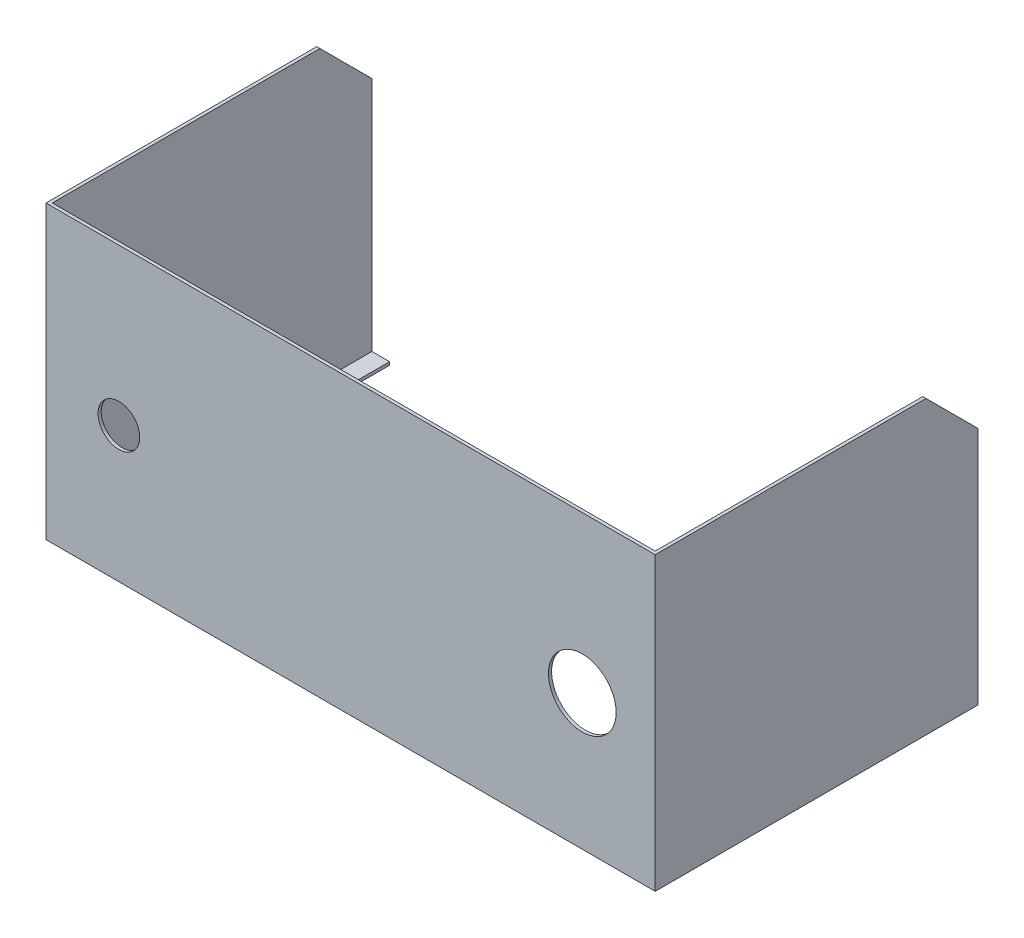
ISO-10303-21;
HEADER;
FILE_DESCRIPTION(('STEP AP214'),'2;1');
FILE_NAME('part.step','',(''),(''),'','','');
FILE_SCHEMA(('AUTOMOTIVE_DESIGN { 1 0 10303 214 1 1 1 1 }'));
ENDSEC;
DATA;
#1=APPLICATION_CONTEXT('core data for automotive mechanical design processes');
#2=APPLICATION_PROTOCOL_DEFINITION('international standard','automotive_design',2000,#1);
#3=PRODUCT_CONTEXT('',#1,'mechanical');
#4=PRODUCT('Part','Part','',(#3));
#5=PRODUCT_RELATED_PRODUCT_CATEGORY('part','',(#4));
#6=PRODUCT_DEFINITION_FORMATION('','',#4);
#7=PRODUCT_DEFINITION_CONTEXT('part definition',#1,'design');
#8=PRODUCT_DEFINITION('design','',#6,#7);
#9=PRODUCT_DEFINITION_SHAPE('','',#8);
#10=(LENGTH_UNIT() NAMED_UNIT(*) SI_UNIT(.MILLI.,.METRE.));
#11=(NAMED_UNIT(*) PLANE_ANGLE_UNIT() SI_UNIT($,.RADIAN.));
#12=(NAMED_UNIT(*) SI_UNIT($,.STERADIAN.) SOLID_ANGLE_UNIT());
#13=UNCERTAINTY_MEASURE_WITH_UNIT(LENGTH_MEASURE(1.E-05),#10,'distance_accuracy_value','');
#14=(GEOMETRIC_REPRESENTATION_CONTEXT(3) GLOBAL_UNCERTAINTY_ASSIGNED_CONTEXT((#13)) GLOBAL_UNIT_ASSIGNED_CONTEXT((#10,
#11,#12)) REPRESENTATION_CONTEXT('',''));
#15=CARTESIAN_POINT('',(0.,0.,0.));
#16=DIRECTION('',(0.,0.,1.));
#17=DIRECTION('',(1.,0.,0.));
#18=AXIS2_PLACEMENT_3D('',#15,#16,#17);
#19=CARTESIAN_POINT('',(0.,0.,0.));
#20=DIRECTION('',(0.,0.,-1.));
#21=DIRECTION('',(-1.,0.,0.));
#22=AXIS2_PLACEMENT_3D('',#19,#20,#21);
#23=PLANE('',#22);
#24=CARTESIAN_POINT('',(-222.5,-10.,0.));
#25=DIRECTION('',(0.,0.,1.));
#26=DIRECTION('',(1.,0.,0.));
#27=AXIS2_PLACEMENT_3D('',#24,#25,#26);
#28=CIRCLE('',#27,20.);
#29=CARTESIAN_POINT('',(-202.5,-10.,0.));
#30=VERTEX_POINT('',#29);
#31=EDGE_CURVE('E243',#30,#30,#28,.T.);
#32=ORIENTED_EDGE('',*,*,#31,.T.);
#33=EDGE_LOOP('',(#32));
#34=FACE_BOUND('',#33,.T.);
#35=CARTESIAN_POINT('',(222.5,-9.99999999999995,0.));
#36=DIRECTION('',(0.,0.,1.));
#37=DIRECTION('',(1.,0.,0.));
#38=AXIS2_PLACEMENT_3D('',#35,#36,#37);
#39=CIRCLE('',#38,32.5);
#40=CARTESIAN_POINT('',(255.,-9.99999999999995,0.));
#41=VERTEX_POINT('',#40);
#42=EDGE_CURVE('E235',#41,#41,#39,.T.);
#43=ORIENTED_EDGE('',*,*,#42,.T.);
#44=EDGE_LOOP('',(#43));
#45=FACE_BOUND('',#44,.T.);
#46=DIRECTION('',(0.,-1.,0.));
#47=VECTOR('',#46,1.);
#48=CARTESIAN_POINT('',(289.5,-140.,0.));
#49=LINE('',#48,#47);
#50=CARTESIAN_POINT('',(289.5,140.,0.));
#51=VERTEX_POINT('',#50);
#52=CARTESIAN_POINT('',(289.5,-137.,0.));
#53=VERTEX_POINT('',#52);
#54=EDGE_CURVE('E224',#51,#53,#49,.T.);
#55=ORIENTED_EDGE('',*,*,#54,.T.);
#56=DIRECTION('',(1.,0.,0.));
#57=VECTOR('',#56,1.);
#58=CARTESIAN_POINT('',(0.,-137.,0.));
#59=LINE('',#58,#57);
#60=CARTESIAN_POINT('',(-289.5,-137.,0.));
#61=VERTEX_POINT('',#60);
#62=EDGE_CURVE('E173',#61,#53,#59,.T.);
#63=ORIENTED_EDGE('',*,*,#62,.F.);
#64=DIRECTION('',(0.,1.,0.));
#65=VECTOR('',#64,1.);
#66=CARTESIAN_POINT('',(-289.5,-140.,0.));
#67=LINE('',#66,#65);
#68=CARTESIAN_POINT('',(-289.5,140.,0.));
#69=VERTEX_POINT('',#68);
#70=EDGE_CURVE('E194',#61,#69,#67,.T.);
#71=ORIENTED_EDGE('',*,*,#70,.T.);
#72=DIRECTION('',(-1.,0.,0.));
#73=VECTOR('',#72,1.);
#74=CARTESIAN_POINT('',(292.5,140.,0.));
#75=LINE('',#74,#73);
#76=EDGE_CURVE('E249',#51,#69,#75,.T.);
#77=ORIENTED_EDGE('',*,*,#76,.F.);
#78=EDGE_LOOP('',(#55,#63,#71,#77));
#79=FACE_BOUND('',#78,.T.);
#80=ADVANCED_FACE('F36',(#34,#45,#79),#23,.T.);
#81=CARTESIAN_POINT('',(289.5,0.,0.));
#82=DIRECTION('',(1.,0.,0.));
#83=DIRECTION('',(0.,0.,-1.));
#84=AXIS2_PLACEMENT_3D('',#81,#82,#83);
#85=PLANE('',#84);
#86=DIRECTION('',(0.,0.,-1.));
#87=VECTOR('',#86,1.);
#88=CARTESIAN_POINT('',(289.5,-137.,0.));
#89=LINE('',#88,#87);
#90=CARTESIAN_POINT('',(289.5,-137.,-307.));
#91=VERTEX_POINT('',#90);
#92=EDGE_CURVE('E171',#53,#91,#89,.T.);
#93=ORIENTED_EDGE('',*,*,#92,.F.);
#94=ORIENTED_EDGE('',*,*,#54,.F.);
#95=DIRECTION('',(0.,0.,1.));
#96=VECTOR('',#95,1.);
#97=CARTESIAN_POINT('',(289.5,140.,0.));
#98=LINE('',#97,#96);
#99=CARTESIAN_POINT('',(289.5,140.,-257.));
#100=VERTEX_POINT('',#99);
#101=EDGE_CURVE('E222',#100,#51,#98,.T.);
#102=ORIENTED_EDGE('',*,*,#101,.F.);
#103=DIRECTION('',(0.,0.707106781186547,0.707106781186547));
#104=VECTOR('',#103,1.);
#105=CARTESIAN_POINT('',(289.5,140.,-257.));
#106=LINE('',#105,#104);
#107=CARTESIAN_POINT('',(289.5,90.0000000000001,-307.));
#108=VERTEX_POINT('',#107);
#109=EDGE_CURVE('E218',#108,#100,#106,.T.);
#110=ORIENTED_EDGE('',*,*,#109,.F.);
#111=DIRECTION('',(0.,1.,0.));
#112=VECTOR('',#111,1.);
#113=CARTESIAN_POINT('',(289.5,-140.,-307.));
#114=LINE('',#113,#112);
#115=EDGE_CURVE('E216',#91,#108,#114,.T.);
#116=ORIENTED_EDGE('',*,*,#115,.F.);
#117=EDGE_LOOP('',(#93,#94,#102,#110,#116));
#118=FACE_BOUND('',#117,.T.);
#119=ADVANCED_FACE('F305',(#118),#85,.F.);
#120=CARTESIAN_POINT('',(-289.5,0.,0.));
#121=DIRECTION('',(-1.,0.,0.));
#122=DIRECTION('',(0.,0.,1.));
#123=AXIS2_PLACEMENT_3D('',#120,#121,#122);
#124=PLANE('',#123);
#125=DIRECTION('',(0.,0.,1.));
#126=VECTOR('',#125,1.);
#127=CARTESIAN_POINT('',(-289.5,-137.,0.));
#128=LINE('',#127,#126);
#129=CARTESIAN_POINT('',(-289.5,-137.,-307.));
#130=VERTEX_POINT('',#129);
#131=EDGE_CURVE('E175',#130,#61,#128,.T.);
#132=ORIENTED_EDGE('',*,*,#131,.F.);
#133=DIRECTION('',(0.,-1.,0.));
#134=VECTOR('',#133,1.);
#135=CARTESIAN_POINT('',(-289.5,90.,-307.));
#136=LINE('',#135,#134);
#137=CARTESIAN_POINT('',(-289.5,90.,-307.));
#138=VERTEX_POINT('',#137);
#139=EDGE_CURVE('E191',#138,#130,#136,.T.);
#140=ORIENTED_EDGE('',*,*,#139,.F.);
#141=DIRECTION('',(0.,-0.707106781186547,-0.707106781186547));
#142=VECTOR('',#141,1.);
#143=CARTESIAN_POINT('',(-289.5,140.,-257.));
#144=LINE('',#143,#142);
#145=CARTESIAN_POINT('',(-289.5,140.,-257.));
#146=VERTEX_POINT('',#145);
#147=EDGE_CURVE('E200',#146,#138,#144,.T.);
#148=ORIENTED_EDGE('',*,*,#147,.F.);
#149=DIRECTION('',(0.,0.,-1.));
#150=VECTOR('',#149,1.);
#151=CARTESIAN_POINT('',(-289.5,140.,0.));
#152=LINE('',#151,#150);
#153=EDGE_CURVE('E197',#69,#146,#152,.T.);
#154=ORIENTED_EDGE('',*,*,#153,.F.);
#155=ORIENTED_EDGE('',*,*,#70,.F.);
#156=EDGE_LOOP('',(#132,#140,#148,#154,#155));
#157=FACE_BOUND('',#156,.T.);
#158=ADVANCED_FACE('F295',(#157),#124,.F.);
#159=CARTESIAN_POINT('',(0.,0.,3.));
#160=DIRECTION('',(0.,0.,-1.));
#161=DIRECTION('',(-1.,0.,0.));
#162=AXIS2_PLACEMENT_3D('',#159,#160,#161);
#163=PLANE('',#162);
#164=DIRECTION('',(0.,-1.,0.));
#165=VECTOR('',#164,1.);
#166=CARTESIAN_POINT('',(-292.5,140.,3.));
#167=LINE('',#166,#165);
#168=CARTESIAN_POINT('',(-292.5,140.,3.));
#169=VERTEX_POINT('',#168);
#170=CARTESIAN_POINT('',(-292.5,-140.,3.));
#171=VERTEX_POINT('',#170);
#172=EDGE_CURVE('E252',#169,#171,#167,.T.);
#173=ORIENTED_EDGE('',*,*,#172,.T.);
#174=DIRECTION('',(1.,0.,0.));
#175=VECTOR('',#174,1.);
#176=CARTESIAN_POINT('',(292.5,-140.,3.));
#177=LINE('',#176,#175);
#178=CARTESIAN_POINT('',(292.5,-140.,3.));
#179=VERTEX_POINT('',#178);
#180=EDGE_CURVE('E254',#171,#179,#177,.T.);
#181=ORIENTED_EDGE('',*,*,#180,.T.);
#182=DIRECTION('',(0.,1.,0.));
#183=VECTOR('',#182,1.);
#184=CARTESIAN_POINT('',(292.5,140.,3.));
#185=LINE('',#184,#183);
#186=CARTESIAN_POINT('',(292.5,140.,3.));
#187=VERTEX_POINT('',#186);
#188=EDGE_CURVE('E56',#179,#187,#185,.T.);
#189=ORIENTED_EDGE('',*,*,#188,.T.);
#190=DIRECTION('',(-1.,0.,0.));
#191=VECTOR('',#190,1.);
#192=CARTESIAN_POINT('',(292.5,140.,3.));
#193=LINE('',#192,#191);
#194=EDGE_CURVE('E51',#187,#169,#193,.T.);
#195=ORIENTED_EDGE('',*,*,#194,.T.);
#196=EDGE_LOOP('',(#173,#181,#189,#195));
#197=FACE_BOUND('',#196,.T.);
#198=CARTESIAN_POINT('',(-222.5,-10.,3.));
#199=DIRECTION('',(0.,0.,1.));
#200=DIRECTION('',(1.,0.,0.));
#201=AXIS2_PLACEMENT_3D('',#198,#199,#200);
#202=CIRCLE('',#201,20.);
#203=CARTESIAN_POINT('',(-202.5,-10.,3.));
#204=VERTEX_POINT('',#203);
#205=EDGE_CURVE('E246',#204,#204,#202,.T.);
#206=ORIENTED_EDGE('',*,*,#205,.F.);
#207=EDGE_LOOP('',(#206));
#208=FACE_BOUND('',#207,.T.);
#209=CARTESIAN_POINT('',(222.5,-9.99999999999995,3.));
#210=DIRECTION('',(0.,0.,1.));
#211=DIRECTION('',(1.,0.,0.));
#212=AXIS2_PLACEMENT_3D('',#209,#210,#211);
#213=CIRCLE('',#212,32.5);
#214=CARTESIAN_POINT('',(255.,-9.99999999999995,3.));
#215=VERTEX_POINT('',#214);
#216=EDGE_CURVE('E240',#215,#215,#213,.T.);
#217=ORIENTED_EDGE('',*,*,#216,.F.);
#218=EDGE_LOOP('',(#217));
#219=FACE_BOUND('',#218,.T.);
#220=ADVANCED_FACE('F283',(#197,#208,#219),#163,.F.);
#221=CARTESIAN_POINT('',(-292.5,140.,3.));
#222=DIRECTION('',(1.,0.,0.));
#223=DIRECTION('',(0.,1.,0.));
#224=AXIS2_PLACEMENT_3D('',#221,#222,#223);
#225=PLANE('',#224);
#226=DIRECTION('',(0.,0.,-1.));
#227=VECTOR('',#226,1.);
#228=CARTESIAN_POINT('',(-292.5,140.,3.));
#229=LINE('',#228,#227);
#230=CARTESIAN_POINT('',(-292.5,140.,-257.));
#231=VERTEX_POINT('',#230);
#232=EDGE_CURVE('E258',#169,#231,#229,.T.);
#233=ORIENTED_EDGE('',*,*,#232,.T.);
#234=DIRECTION('',(0.,-0.707106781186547,-0.707106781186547));
#235=VECTOR('',#234,1.);
#236=CARTESIAN_POINT('',(-292.5,140.,-257.));
#237=LINE('',#236,#235);
#238=CARTESIAN_POINT('',(-292.5,90.,-307.));
#239=VERTEX_POINT('',#238);
#240=EDGE_CURVE('E195',#231,#239,#237,.T.);
#241=ORIENTED_EDGE('',*,*,#240,.T.);
#242=DIRECTION('',(0.,-1.,0.));
#243=VECTOR('',#242,1.);
#244=CARTESIAN_POINT('',(-292.5,90.,-307.));
#245=LINE('',#244,#243);
#246=CARTESIAN_POINT('',(-292.5,-140.,-307.));
#247=VERTEX_POINT('',#246);
#248=EDGE_CURVE('E186',#239,#247,#245,.T.);
#249=ORIENTED_EDGE('',*,*,#248,.T.);
#250=DIRECTION('',(0.,0.,-1.));
#251=VECTOR('',#250,1.);
#252=CARTESIAN_POINT('',(-292.5,-140.,3.));
#253=LINE('',#252,#251);
#254=EDGE_CURVE('E11',#171,#247,#253,.T.);
#255=ORIENTED_EDGE('',*,*,#254,.F.);
#256=ORIENTED_EDGE('',*,*,#172,.F.);
#257=EDGE_LOOP('',(#233,#241,#249,#255,#256));
#258=FACE_BOUND('',#257,.T.);
#259=ADVANCED_FACE('F38',(#258),#225,.F.);
#260=CARTESIAN_POINT('',(292.5,-140.,3.));
#261=DIRECTION('',(0.,1.,0.));
#262=DIRECTION('',(-1.,0.,0.));
#263=AXIS2_PLACEMENT_3D('',#260,#261,#262);
#264=PLANE('',#263);
#265=CARTESIAN_POINT('',(280.5,-140.,-92.));
#266=DIRECTION('',(0.,-1.,0.));
#267=DIRECTION('',(1.,0.,0.));
#268=AXIS2_PLACEMENT_3D('',#265,#266,#267);
#269=CIRCLE('',#268,1.74999999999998);
#270=CARTESIAN_POINT('',(282.25,-140.,-92.));
#271=VERTEX_POINT('',#270);
#272=EDGE_CURVE('E343',#271,#271,#269,.T.);
#273=ORIENTED_EDGE('',*,*,#272,.F.);
#274=EDGE_LOOP('',(#273));
#275=FACE_BOUND('',#274,.T.);
#276=CARTESIAN_POINT('',(137.5,-140.,-9.00000000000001));
#277=DIRECTION('',(0.,-1.,0.));
#278=DIRECTION('',(1.,0.,0.));
#279=AXIS2_PLACEMENT_3D('',#276,#277,#278);
#280=CIRCLE('',#279,1.75000000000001);
#281=CARTESIAN_POINT('',(139.25,-140.,-9.00000000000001));
#282=VERTEX_POINT('',#281);
#283=EDGE_CURVE('E347',#282,#282,#280,.T.);
#284=ORIENTED_EDGE('',*,*,#283,.F.);
#285=EDGE_LOOP('',(#284));
#286=FACE_BOUND('',#285,.T.);
#287=CARTESIAN_POINT('',(0.,-140.,-9.00000000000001));
#288=DIRECTION('',(0.,-1.,0.));
#289=DIRECTION('',(1.,0.,0.));
#290=AXIS2_PLACEMENT_3D('',#287,#288,#289);
#291=CIRCLE('',#290,1.75);
#292=CARTESIAN_POINT('',(1.75000000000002,-140.,-9.00000000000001));
#293=VERTEX_POINT('',#292);
#294=EDGE_CURVE('E351',#293,#293,#291,.T.);
#295=ORIENTED_EDGE('',*,*,#294,.F.);
#296=EDGE_LOOP('',(#295));
#297=FACE_BOUND('',#296,.T.);
#298=CARTESIAN_POINT('',(-137.5,-140.,-9.00000000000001));
#299=DIRECTION('',(0.,-1.,0.));
#300=DIRECTION('',(1.,0.,0.));
#301=AXIS2_PLACEMENT_3D('',#298,#299,#300);
#302=CIRCLE('',#301,1.75000000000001);
#303=CARTESIAN_POINT('',(-135.75,-140.,-9.00000000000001));
#304=VERTEX_POINT('',#303);
#305=EDGE_CURVE('E355',#304,#304,#302,.T.);
#306=ORIENTED_EDGE('',*,*,#305,.F.);
#307=EDGE_LOOP('',(#306));
#308=FACE_BOUND('',#307,.T.);
#309=CARTESIAN_POINT('',(-280.5,-140.,-232.));
#310=DIRECTION('',(0.,-1.,0.));
#311=DIRECTION('',(1.,0.,0.));
#312=AXIS2_PLACEMENT_3D('',#309,#310,#311);
#313=CIRCLE('',#312,1.74999999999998);
#314=CARTESIAN_POINT('',(-278.75,-140.,-232.));
#315=VERTEX_POINT('',#314);
#316=EDGE_CURVE('E359',#315,#315,#313,.T.);
#317=ORIENTED_EDGE('',*,*,#316,.F.);
#318=EDGE_LOOP('',(#317));
#319=FACE_BOUND('',#318,.T.);
#320=CARTESIAN_POINT('',(-280.5,-140.,-92.));
#321=DIRECTION('',(0.,-1.,0.));
#322=DIRECTION('',(1.,0.,0.));
#323=AXIS2_PLACEMENT_3D('',#320,#321,#322);
#324=CIRCLE('',#323,1.74999999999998);
#325=CARTESIAN_POINT('',(-278.75,-140.,-92.));
#326=VERTEX_POINT('',#325);
#327=EDGE_CURVE('E363',#326,#326,#324,.T.);
#328=ORIENTED_EDGE('',*,*,#327,.F.);
#329=EDGE_LOOP('',(#328));
#330=FACE_BOUND('',#329,.T.);
#331=CARTESIAN_POINT('',(280.5,-140.,-232.));
#332=DIRECTION('',(0.,-1.,0.));
#333=DIRECTION('',(1.,0.,0.));
#334=AXIS2_PLACEMENT_3D('',#331,#332,#333);
#335=CIRCLE('',#334,1.74999999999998);
#336=CARTESIAN_POINT('',(282.25,-140.,-232.));
#337=VERTEX_POINT('',#336);
#338=EDGE_CURVE('E167',#337,#337,#335,.T.);
#339=ORIENTED_EDGE('',*,*,#338,.F.);
#340=EDGE_LOOP('',(#339));
#341=FACE_BOUND('',#340,.T.);
#342=DIRECTION('',(0.,0.,1.));
#343=VECTOR('',#342,1.);
#344=CARTESIAN_POINT('',(272.5,-140.,0.));
#345=LINE('',#344,#343);
#346=CARTESIAN_POINT('',(272.5,-140.,-307.));
#347=VERTEX_POINT('',#346);
#348=CARTESIAN_POINT('',(272.5,-140.,-17.));
#349=VERTEX_POINT('',#348);
#350=EDGE_CURVE('E152',#347,#349,#345,.T.);
#351=ORIENTED_EDGE('',*,*,#350,.F.);
#352=DIRECTION('',(1.,0.,0.));
#353=VECTOR('',#352,1.);
#354=CARTESIAN_POINT('',(289.5,-140.,-307.));
#355=LINE('',#354,#353);
#356=CARTESIAN_POINT('',(292.5,-140.,-307.));
#357=VERTEX_POINT('',#356);
#358=EDGE_CURVE('E227',#347,#357,#355,.T.);
#359=ORIENTED_EDGE('',*,*,#358,.T.);
#360=DIRECTION('',(0.,0.,-1.));
#361=VECTOR('',#360,1.);
#362=CARTESIAN_POINT('',(292.5,-140.,3.));
#363=LINE('',#362,#361);
#364=EDGE_CURVE('E44',#179,#357,#363,.T.);
#365=ORIENTED_EDGE('',*,*,#364,.F.);
#366=ORIENTED_EDGE('',*,*,#180,.F.);
#367=ORIENTED_EDGE('',*,*,#254,.T.);
#368=DIRECTION('',(-1.,0.,0.));
#369=VECTOR('',#368,1.);
#370=CARTESIAN_POINT('',(-289.5,-140.,-307.));
#371=LINE('',#370,#369);
#372=CARTESIAN_POINT('',(-272.5,-140.,-307.));
#373=VERTEX_POINT('',#372);
#374=EDGE_CURVE('E203',#373,#247,#371,.T.);
#375=ORIENTED_EDGE('',*,*,#374,.F.);
#376=DIRECTION('',(0.,0.,1.));
#377=VECTOR('',#376,1.);
#378=CARTESIAN_POINT('',(-272.5,-140.,0.));
#379=LINE('',#378,#377);
#380=CARTESIAN_POINT('',(-272.5,-140.,-17.));
#381=VERTEX_POINT('',#380);
#382=EDGE_CURVE('E162',#373,#381,#379,.T.);
#383=ORIENTED_EDGE('',*,*,#382,.T.);
#384=DIRECTION('',(-1.,0.,0.));
#385=VECTOR('',#384,1.);
#386=CARTESIAN_POINT('',(0.,-140.,-17.));
#387=LINE('',#386,#385);
#388=EDGE_CURVE('E181',#349,#381,#387,.T.);
#389=ORIENTED_EDGE('',*,*,#388,.F.);
#390=EDGE_LOOP('',(#351,#359,#365,#366,#367,#375,#383,#389));
#391=FACE_BOUND('',#390,.T.);
#392=ADVANCED_FACE('F268',(#275,#286,#297,#308,#319,#330,#341,#391),#264,.F.);
#393=CARTESIAN_POINT('',(292.5,140.,3.));
#394=DIRECTION('',(-1.,0.,0.));
#395=DIRECTION('',(0.,0.,1.));
#396=AXIS2_PLACEMENT_3D('',#393,#394,#395);
#397=PLANE('',#396);
#398=ORIENTED_EDGE('',*,*,#364,.T.);
#399=DIRECTION('',(0.,1.,0.));
#400=VECTOR('',#399,1.);
#401=CARTESIAN_POINT('',(292.5,-140.,-307.));
#402=LINE('',#401,#400);
#403=CARTESIAN_POINT('',(292.5,90.0000000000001,-307.));
#404=VERTEX_POINT('',#403);
#405=EDGE_CURVE('E210',#357,#404,#402,.T.);
#406=ORIENTED_EDGE('',*,*,#405,.T.);
#407=DIRECTION('',(0.,0.707106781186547,0.707106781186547));
#408=VECTOR('',#407,1.);
#409=CARTESIAN_POINT('',(292.5,140.,-257.));
#410=LINE('',#409,#408);
#411=CARTESIAN_POINT('',(292.5,140.,-257.));
#412=VERTEX_POINT('',#411);
#413=EDGE_CURVE('E219',#404,#412,#410,.T.);
#414=ORIENTED_EDGE('',*,*,#413,.T.);
#415=DIRECTION('',(0.,0.,-1.));
#416=VECTOR('',#415,1.);
#417=CARTESIAN_POINT('',(292.5,140.,3.));
#418=LINE('',#417,#416);
#419=EDGE_CURVE('E262',#187,#412,#418,.T.);
#420=ORIENTED_EDGE('',*,*,#419,.F.);
#421=ORIENTED_EDGE('',*,*,#188,.F.);
#422=EDGE_LOOP('',(#398,#406,#414,#420,#421));
#423=FACE_BOUND('',#422,.T.);
#424=ADVANCED_FACE('F265',(#423),#397,.F.);
#425=CARTESIAN_POINT('',(292.5,140.,3.));
#426=DIRECTION('',(0.,-1.,0.));
#427=DIRECTION('',(1.,0.,0.));
#428=AXIS2_PLACEMENT_3D('',#425,#426,#427);
#429=PLANE('',#428);
#430=ORIENTED_EDGE('',*,*,#419,.T.);
#431=DIRECTION('',(1.,0.,0.));
#432=VECTOR('',#431,1.);
#433=CARTESIAN_POINT('',(289.5,140.,-257.));
#434=LINE('',#433,#432);
#435=EDGE_CURVE('E232',#100,#412,#434,.T.);
#436=ORIENTED_EDGE('',*,*,#435,.F.);
#437=ORIENTED_EDGE('',*,*,#101,.T.);
#438=ORIENTED_EDGE('',*,*,#76,.T.);
#439=ORIENTED_EDGE('',*,*,#153,.T.);
#440=DIRECTION('',(-1.,0.,0.));
#441=VECTOR('',#440,1.);
#442=CARTESIAN_POINT('',(-289.5,140.,-257.));
#443=LINE('',#442,#441);
#444=EDGE_CURVE('E211',#146,#231,#443,.T.);
#445=ORIENTED_EDGE('',*,*,#444,.T.);
#446=ORIENTED_EDGE('',*,*,#232,.F.);
#447=ORIENTED_EDGE('',*,*,#194,.F.);
#448=EDGE_LOOP('',(#430,#436,#437,#438,#439,#445,#446,#447));
#449=FACE_BOUND('',#448,.T.);
#450=ADVANCED_FACE('F278',(#449),#429,.F.);
#451=CARTESIAN_POINT('',(-222.5,-10.,3.));
#452=DIRECTION('',(0.,0.,-1.));
#453=DIRECTION('',(-1.,0.,0.));
#454=AXIS2_PLACEMENT_3D('',#451,#452,#453);
#455=CYLINDRICAL_SURFACE('',#454,20.);
#456=ORIENTED_EDGE('',*,*,#205,.T.);
#457=EDGE_LOOP('',(#456));
#458=FACE_BOUND('',#457,.T.);
#459=ORIENTED_EDGE('',*,*,#31,.F.);
#460=EDGE_LOOP('',(#459));
#461=FACE_BOUND('',#460,.T.);
#462=ADVANCED_FACE('F325',(#458,#461),#455,.F.);
#463=CARTESIAN_POINT('',(222.5,-9.99999999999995,3.));
#464=DIRECTION('',(0.,0.,-1.));
#465=DIRECTION('',(-1.,0.,0.));
#466=AXIS2_PLACEMENT_3D('',#463,#464,#465);
#467=CYLINDRICAL_SURFACE('',#466,32.5);
#468=ORIENTED_EDGE('',*,*,#216,.T.);
#469=EDGE_LOOP('',(#468));
#470=FACE_BOUND('',#469,.T.);
#471=ORIENTED_EDGE('',*,*,#42,.F.);
#472=EDGE_LOOP('',(#471));
#473=FACE_BOUND('',#472,.T.);
#474=ADVANCED_FACE('F320',(#470,#473),#467,.F.);
#475=CARTESIAN_POINT('',(289.5,140.,-257.));
#476=DIRECTION('',(0.,0.707106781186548,-0.707106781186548));
#477=DIRECTION('',(0.,0.707106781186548,0.707106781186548));
#478=AXIS2_PLACEMENT_3D('',#475,#476,#477);
#479=PLANE('',#478);
#480=ORIENTED_EDGE('',*,*,#413,.F.);
#481=DIRECTION('',(1.,0.,0.));
#482=VECTOR('',#481,1.);
#483=CARTESIAN_POINT('',(289.5,90.0000000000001,-307.));
#484=LINE('',#483,#482);
#485=EDGE_CURVE('E236',#108,#404,#484,.T.);
#486=ORIENTED_EDGE('',*,*,#485,.F.);
#487=ORIENTED_EDGE('',*,*,#109,.T.);
#488=ORIENTED_EDGE('',*,*,#435,.T.);
#489=EDGE_LOOP('',(#480,#486,#487,#488));
#490=FACE_BOUND('',#489,.T.);
#491=ADVANCED_FACE('F276',(#490),#479,.T.);
#492=CARTESIAN_POINT('',(289.5,-140.,-307.));
#493=DIRECTION('',(0.,0.,-1.));
#494=DIRECTION('',(-1.,0.,0.));
#495=AXIS2_PLACEMENT_3D('',#492,#493,#494);
#496=PLANE('',#495);
#497=ORIENTED_EDGE('',*,*,#405,.F.);
#498=ORIENTED_EDGE('',*,*,#358,.F.);
#499=DIRECTION('',(0.,-1.,0.));
#500=VECTOR('',#499,1.);
#501=CARTESIAN_POINT('',(272.5,-137.,-307.));
#502=LINE('',#501,#500);
#503=CARTESIAN_POINT('',(272.5,-137.,-307.));
#504=VERTEX_POINT('',#503);
#505=EDGE_CURVE('E156',#504,#347,#502,.T.);
#506=ORIENTED_EDGE('',*,*,#505,.F.);
#507=DIRECTION('',(-1.,0.,0.));
#508=VECTOR('',#507,1.);
#509=CARTESIAN_POINT('',(-1.98272813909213E-12,-137.,-306.999999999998));
#510=LINE('',#509,#508);
#511=EDGE_CURVE('E143',#91,#504,#510,.T.);
#512=ORIENTED_EDGE('',*,*,#511,.F.);
#513=ORIENTED_EDGE('',*,*,#115,.T.);
#514=ORIENTED_EDGE('',*,*,#485,.T.);
#515=EDGE_LOOP('',(#497,#498,#506,#512,#513,#514));
#516=FACE_BOUND('',#515,.T.);
#517=ADVANCED_FACE('F270',(#516),#496,.T.);
#518=CARTESIAN_POINT('',(-289.5,90.,-307.));
#519=DIRECTION('',(0.,0.,-1.));
#520=DIRECTION('',(-1.,0.,0.));
#521=AXIS2_PLACEMENT_3D('',#518,#519,#520);
#522=PLANE('',#521);
#523=ORIENTED_EDGE('',*,*,#248,.F.);
#524=DIRECTION('',(-1.,0.,0.));
#525=VECTOR('',#524,1.);
#526=CARTESIAN_POINT('',(-289.5,90.,-307.));
#527=LINE('',#526,#525);
#528=EDGE_CURVE('E208',#138,#239,#527,.T.);
#529=ORIENTED_EDGE('',*,*,#528,.F.);
#530=ORIENTED_EDGE('',*,*,#139,.T.);
#531=DIRECTION('',(1.,0.,0.));
#532=VECTOR('',#531,1.);
#533=CARTESIAN_POINT('',(0.,-137.,-307.));
#534=LINE('',#533,#532);
#535=CARTESIAN_POINT('',(-272.5,-137.,-307.));
#536=VERTEX_POINT('',#535);
#537=EDGE_CURVE('E177',#130,#536,#534,.T.);
#538=ORIENTED_EDGE('',*,*,#537,.T.);
#539=DIRECTION('',(0.,-1.,0.));
#540=VECTOR('',#539,1.);
#541=CARTESIAN_POINT('',(-272.5,-137.,-307.));
#542=LINE('',#541,#540);
#543=EDGE_CURVE('E187',#536,#373,#542,.T.);
#544=ORIENTED_EDGE('',*,*,#543,.T.);
#545=ORIENTED_EDGE('',*,*,#374,.T.);
#546=EDGE_LOOP('',(#523,#529,#530,#538,#544,#545));
#547=FACE_BOUND('',#546,.T.);
#548=ADVANCED_FACE('F287',(#547),#522,.T.);
#549=CARTESIAN_POINT('',(-289.5,140.,-257.));
#550=DIRECTION('',(0.,0.707106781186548,-0.707106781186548));
#551=DIRECTION('',(0.,0.707106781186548,0.707106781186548));
#552=AXIS2_PLACEMENT_3D('',#549,#550,#551);
#553=PLANE('',#552);
#554=ORIENTED_EDGE('',*,*,#240,.F.);
#555=ORIENTED_EDGE('',*,*,#444,.F.);
#556=ORIENTED_EDGE('',*,*,#147,.T.);
#557=ORIENTED_EDGE('',*,*,#528,.T.);
#558=EDGE_LOOP('',(#554,#555,#556,#557));
#559=FACE_BOUND('',#558,.T.);
#560=ADVANCED_FACE('F290',(#559),#553,.T.);
#561=CARTESIAN_POINT('',(0.,-137.,-17.));
#562=DIRECTION('',(0.,0.,1.));
#563=DIRECTION('',(1.,0.,0.));
#564=AXIS2_PLACEMENT_3D('',#561,#562,#563);
#565=PLANE('',#564);
#566=ORIENTED_EDGE('',*,*,#388,.T.);
#567=DIRECTION('',(0.,-1.,0.));
#568=VECTOR('',#567,1.);
#569=CARTESIAN_POINT('',(-272.5,-137.,-17.));
#570=LINE('',#569,#568);
#571=CARTESIAN_POINT('',(-272.5,-137.,-17.));
#572=VERTEX_POINT('',#571);
#573=EDGE_CURVE('E160',#572,#381,#570,.T.);
#574=ORIENTED_EDGE('',*,*,#573,.F.);
#575=DIRECTION('',(-1.,0.,0.));
#576=VECTOR('',#575,1.);
#577=CARTESIAN_POINT('',(0.,-137.,-17.));
#578=LINE('',#577,#576);
#579=CARTESIAN_POINT('',(272.5,-137.,-17.));
#580=VERTEX_POINT('',#579);
#581=EDGE_CURVE('E140',#580,#572,#578,.T.);
#582=ORIENTED_EDGE('',*,*,#581,.F.);
#583=DIRECTION('',(0.,-1.,0.));
#584=VECTOR('',#583,1.);
#585=CARTESIAN_POINT('',(272.5,-137.,-17.));
#586=LINE('',#585,#584);
#587=EDGE_CURVE('E149',#580,#349,#586,.T.);
#588=ORIENTED_EDGE('',*,*,#587,.T.);
#589=EDGE_LOOP('',(#566,#574,#582,#588));
#590=FACE_BOUND('',#589,.T.);
#591=ADVANCED_FACE('F159',(#590),#565,.F.);
#592=CARTESIAN_POINT('',(-272.5,-137.,0.));
#593=DIRECTION('',(1.,0.,0.));
#594=DIRECTION('',(0.,1.,0.));
#595=AXIS2_PLACEMENT_3D('',#592,#593,#594);
#596=PLANE('',#595);
#597=ORIENTED_EDGE('',*,*,#382,.F.);
#598=ORIENTED_EDGE('',*,*,#543,.F.);
#599=DIRECTION('',(0.,0.,1.));
#600=VECTOR('',#599,1.);
#601=CARTESIAN_POINT('',(-272.5,-137.,0.));
#602=LINE('',#601,#600);
#603=EDGE_CURVE('E157',#536,#572,#602,.T.);
#604=ORIENTED_EDGE('',*,*,#603,.T.);
#605=ORIENTED_EDGE('',*,*,#573,.T.);
#606=EDGE_LOOP('',(#597,#598,#604,#605));
#607=FACE_BOUND('',#606,.T.);
#608=ADVANCED_FACE('F415',(#607),#596,.T.);
#609=CARTESIAN_POINT('',(272.5,-137.,0.));
#610=DIRECTION('',(1.,0.,0.));
#611=DIRECTION('',(0.,1.,0.));
#612=AXIS2_PLACEMENT_3D('',#609,#610,#611);
#613=PLANE('',#612);
#614=ORIENTED_EDGE('',*,*,#350,.T.);
#615=ORIENTED_EDGE('',*,*,#587,.F.);
#616=DIRECTION('',(0.,0.,1.));
#617=VECTOR('',#616,1.);
#618=CARTESIAN_POINT('',(272.5,-137.,0.));
#619=LINE('',#618,#617);
#620=EDGE_CURVE('E135',#504,#580,#619,.T.);
#621=ORIENTED_EDGE('',*,*,#620,.F.);
#622=ORIENTED_EDGE('',*,*,#505,.T.);
#623=EDGE_LOOP('',(#614,#615,#621,#622));
#624=FACE_BOUND('',#623,.T.);
#625=ADVANCED_FACE('F150',(#624),#613,.F.);
#626=CARTESIAN_POINT('',(0.,-137.,0.));
#627=DIRECTION('',(0.,-1.,0.));
#628=DIRECTION('',(1.,0.,0.));
#629=AXIS2_PLACEMENT_3D('',#626,#627,#628);
#630=PLANE('',#629);
#631=CARTESIAN_POINT('',(280.5,-137.,-92.));
#632=DIRECTION('',(0.,-1.,0.));
#633=DIRECTION('',(1.,0.,0.));
#634=AXIS2_PLACEMENT_3D('',#631,#632,#633);
#635=CIRCLE('',#634,1.74999999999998);
#636=CARTESIAN_POINT('',(282.25,-137.,-92.));
#637=VERTEX_POINT('',#636);
#638=EDGE_CURVE('E367',#637,#637,#635,.T.);
#639=ORIENTED_EDGE('',*,*,#638,.T.);
#640=EDGE_LOOP('',(#639));
#641=FACE_BOUND('',#640,.T.);
#642=CARTESIAN_POINT('',(137.5,-137.,-9.00000000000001));
#643=DIRECTION('',(0.,-1.,0.));
#644=DIRECTION('',(1.,0.,0.));
#645=AXIS2_PLACEMENT_3D('',#642,#643,#644);
#646=CIRCLE('',#645,1.75000000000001);
#647=CARTESIAN_POINT('',(139.25,-137.,-9.00000000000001));
#648=VERTEX_POINT('',#647);
#649=EDGE_CURVE('E373',#648,#648,#646,.T.);
#650=ORIENTED_EDGE('',*,*,#649,.T.);
#651=EDGE_LOOP('',(#650));
#652=FACE_BOUND('',#651,.T.);
#653=CARTESIAN_POINT('',(0.,-137.,-9.00000000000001));
#654=DIRECTION('',(0.,-1.,0.));
#655=DIRECTION('',(1.,0.,0.));
#656=AXIS2_PLACEMENT_3D('',#653,#654,#655);
#657=CIRCLE('',#656,1.75);
#658=CARTESIAN_POINT('',(1.75000000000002,-137.,-9.00000000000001));
#659=VERTEX_POINT('',#658);
#660=EDGE_CURVE('E379',#659,#659,#657,.T.);
#661=ORIENTED_EDGE('',*,*,#660,.T.);
#662=EDGE_LOOP('',(#661));
#663=FACE_BOUND('',#662,.T.);
#664=CARTESIAN_POINT('',(-137.5,-137.,-9.00000000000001));
#665=DIRECTION('',(0.,-1.,0.));
#666=DIRECTION('',(1.,0.,0.));
#667=AXIS2_PLACEMENT_3D('',#664,#665,#666);
#668=CIRCLE('',#667,1.75000000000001);
#669=CARTESIAN_POINT('',(-135.75,-137.,-9.00000000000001));
#670=VERTEX_POINT('',#669);
#671=EDGE_CURVE('E383',#670,#670,#668,.T.);
#672=ORIENTED_EDGE('',*,*,#671,.T.);
#673=EDGE_LOOP('',(#672));
#674=FACE_BOUND('',#673,.T.);
#675=CARTESIAN_POINT('',(-280.5,-137.,-232.));
#676=DIRECTION('',(0.,-1.,0.));
#677=DIRECTION('',(1.,0.,0.));
#678=AXIS2_PLACEMENT_3D('',#675,#676,#677);
#679=CIRCLE('',#678,1.74999999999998);
#680=CARTESIAN_POINT('',(-278.75,-137.,-232.));
#681=VERTEX_POINT('',#680);
#682=EDGE_CURVE('E387',#681,#681,#679,.T.);
#683=ORIENTED_EDGE('',*,*,#682,.T.);
#684=EDGE_LOOP('',(#683));
#685=FACE_BOUND('',#684,.T.);
#686=CARTESIAN_POINT('',(-280.5,-137.,-92.));
#687=DIRECTION('',(0.,-1.,0.));
#688=DIRECTION('',(1.,0.,0.));
#689=AXIS2_PLACEMENT_3D('',#686,#687,#688);
#690=CIRCLE('',#689,1.74999999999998);
#691=CARTESIAN_POINT('',(-278.75,-137.,-92.));
#692=VERTEX_POINT('',#691);
#693=EDGE_CURVE('E391',#692,#692,#690,.T.);
#694=ORIENTED_EDGE('',*,*,#693,.T.);
#695=EDGE_LOOP('',(#694));
#696=FACE_BOUND('',#695,.T.);
#697=CARTESIAN_POINT('',(280.5,-137.,-232.));
#698=DIRECTION('',(0.,-1.,0.));
#699=DIRECTION('',(1.,0.,0.));
#700=AXIS2_PLACEMENT_3D('',#697,#698,#699);
#701=CIRCLE('',#700,1.74999999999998);
#702=CARTESIAN_POINT('',(282.25,-137.,-232.));
#703=VERTEX_POINT('',#702);
#704=EDGE_CURVE('E183',#703,#703,#701,.T.);
#705=ORIENTED_EDGE('',*,*,#704,.T.);
#706=EDGE_LOOP('',(#705));
#707=FACE_BOUND('',#706,.T.);
#708=ORIENTED_EDGE('',*,*,#581,.T.);
#709=ORIENTED_EDGE('',*,*,#603,.F.);
#710=ORIENTED_EDGE('',*,*,#537,.F.);
#711=ORIENTED_EDGE('',*,*,#131,.T.);
#712=ORIENTED_EDGE('',*,*,#62,.T.);
#713=ORIENTED_EDGE('',*,*,#92,.T.);
#714=ORIENTED_EDGE('',*,*,#511,.T.);
#715=ORIENTED_EDGE('',*,*,#620,.T.);
#716=EDGE_LOOP('',(#708,#709,#710,#711,#712,#713,#714,#715));
#717=FACE_BOUND('',#716,.T.);
#718=ADVANCED_FACE('F137',(#641,#652,#663,#674,#685,#696,#707,#717),#630,.F.);
#719=CARTESIAN_POINT('',(280.5,-137.,-232.));
#720=DIRECTION('',(0.,-1.,0.));
#721=DIRECTION('',(1.,0.,0.));
#722=AXIS2_PLACEMENT_3D('',#719,#720,#721);
#723=CYLINDRICAL_SURFACE('',#722,1.74999999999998);
#724=ORIENTED_EDGE('',*,*,#704,.F.);
#725=EDGE_LOOP('',(#724));
#726=FACE_BOUND('',#725,.T.);
#727=ORIENTED_EDGE('',*,*,#338,.T.);
#728=EDGE_LOOP('',(#727));
#729=FACE_BOUND('',#728,.T.);
#730=ADVANCED_FACE('F398',(#726,#729),#723,.F.);
#731=CARTESIAN_POINT('',(-280.5,-137.,-92.));
#732=DIRECTION('',(0.,-1.,0.));
#733=DIRECTION('',(1.,0.,0.));
#734=AXIS2_PLACEMENT_3D('',#731,#732,#733);
#735=CYLINDRICAL_SURFACE('',#734,1.74999999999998);
#736=ORIENTED_EDGE('',*,*,#693,.F.);
#737=EDGE_LOOP('',(#736));
#738=FACE_BOUND('',#737,.T.);
#739=ORIENTED_EDGE('',*,*,#327,.T.);
#740=EDGE_LOOP('',(#739));
#741=FACE_BOUND('',#740,.T.);
#742=ADVANCED_FACE('F395',(#738,#741),#735,.F.);
#743=CARTESIAN_POINT('',(-280.5,-137.,-232.));
#744=DIRECTION('',(0.,-1.,0.));
#745=DIRECTION('',(1.,0.,0.));
#746=AXIS2_PLACEMENT_3D('',#743,#744,#745);
#747=CYLINDRICAL_SURFACE('',#746,1.74999999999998);
#748=ORIENTED_EDGE('',*,*,#682,.F.);
#749=EDGE_LOOP('',(#748));
#750=FACE_BOUND('',#749,.T.);
#751=ORIENTED_EDGE('',*,*,#316,.T.);
#752=EDGE_LOOP('',(#751));
#753=FACE_BOUND('',#752,.T.);
#754=ADVANCED_FACE('F397',(#750,#753),#747,.F.);
#755=CARTESIAN_POINT('',(-137.5,-137.,-9.00000000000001));
#756=DIRECTION('',(0.,-1.,0.));
#757=DIRECTION('',(1.,0.,0.));
#758=AXIS2_PLACEMENT_3D('',#755,#756,#757);
#759=CYLINDRICAL_SURFACE('',#758,1.75000000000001);
#760=ORIENTED_EDGE('',*,*,#671,.F.);
#761=EDGE_LOOP('',(#760));
#762=FACE_BOUND('',#761,.T.);
#763=ORIENTED_EDGE('',*,*,#305,.T.);
#764=EDGE_LOOP('',(#763));
#765=FACE_BOUND('',#764,.T.);
#766=ADVANCED_FACE('F405',(#762,#765),#759,.F.);
#767=CARTESIAN_POINT('',(0.,-137.,-9.00000000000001));
#768=DIRECTION('',(0.,-1.,0.));
#769=DIRECTION('',(1.,0.,0.));
#770=AXIS2_PLACEMENT_3D('',#767,#768,#769);
#771=CYLINDRICAL_SURFACE('',#770,1.75);
#772=ORIENTED_EDGE('',*,*,#660,.F.);
#773=EDGE_LOOP('',(#772));
#774=FACE_BOUND('',#773,.T.);
#775=ORIENTED_EDGE('',*,*,#294,.T.);
#776=EDGE_LOOP('',(#775));
#777=FACE_BOUND('',#776,.T.);
#778=ADVANCED_FACE('F558',(#774,#777),#771,.F.);
#779=CARTESIAN_POINT('',(137.5,-137.,-9.00000000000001));
#780=DIRECTION('',(0.,-1.,0.));
#781=DIRECTION('',(1.,0.,0.));
#782=AXIS2_PLACEMENT_3D('',#779,#780,#781);
#783=CYLINDRICAL_SURFACE('',#782,1.75000000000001);
#784=ORIENTED_EDGE('',*,*,#649,.F.);
#785=EDGE_LOOP('',(#784));
#786=FACE_BOUND('',#785,.T.);
#787=ORIENTED_EDGE('',*,*,#283,.T.);
#788=EDGE_LOOP('',(#787));
#789=FACE_BOUND('',#788,.T.);
#790=ADVANCED_FACE('F566',(#786,#789),#783,.F.);
#791=CARTESIAN_POINT('',(280.5,-137.,-92.));
#792=DIRECTION('',(0.,-1.,0.));
#793=DIRECTION('',(1.,0.,0.));
#794=AXIS2_PLACEMENT_3D('',#791,#792,#793);
#795=CYLINDRICAL_SURFACE('',#794,1.74999999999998);
#796=ORIENTED_EDGE('',*,*,#638,.F.);
#797=EDGE_LOOP('',(#796));
#798=FACE_BOUND('',#797,.T.);
#799=ORIENTED_EDGE('',*,*,#272,.T.);
#800=EDGE_LOOP('',(#799));
#801=FACE_BOUND('',#800,.T.);
#802=ADVANCED_FACE('F575',(#798,#801),#795,.F.);
#803=CLOSED_SHELL('',(#80,#119,#158,#220,#259,#392,#424,#450,#462,#474,#491,#517,#548,#560,#591,
#608,#625,#718,#730,#742,#754,#766,#778,#790,#802));
#804=MANIFOLD_SOLID_BREP('B2',#803);
#805=ADVANCED_BREP_SHAPE_REPRESENTATION('',(#18,#804),#14);
#806=SHAPE_DEFINITION_REPRESENTATION(#9,#805);
ENDSEC;
END-ISO-10303-21;
